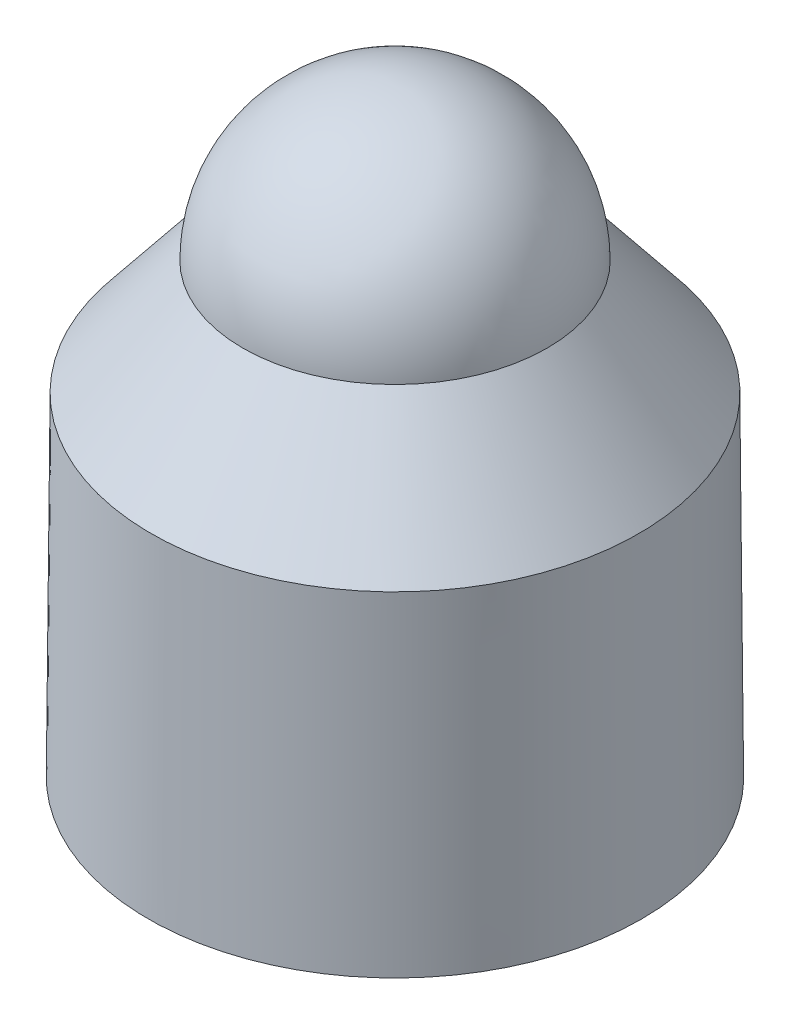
ISO-10303-21;
HEADER;
FILE_DESCRIPTION(('STEP AP214'),'2;1');
FILE_NAME('part.step','',(''),(''),'','','');
FILE_SCHEMA(('AUTOMOTIVE_DESIGN { 1 0 10303 214 1 1 1 1 }'));
ENDSEC;
DATA;
#1=APPLICATION_CONTEXT('core data for automotive mechanical design processes');
#2=APPLICATION_PROTOCOL_DEFINITION('international standard','automotive_design',2000,#1);
#3=PRODUCT_CONTEXT('',#1,'mechanical');
#4=PRODUCT('Part','Part','',(#3));
#5=PRODUCT_RELATED_PRODUCT_CATEGORY('part','',(#4));
#6=PRODUCT_DEFINITION_FORMATION('','',#4);
#7=PRODUCT_DEFINITION_CONTEXT('part definition',#1,'design');
#8=PRODUCT_DEFINITION('design','',#6,#7);
#9=PRODUCT_DEFINITION_SHAPE('','',#8);
#10=(LENGTH_UNIT() NAMED_UNIT(*) SI_UNIT(.MILLI.,.METRE.));
#11=(NAMED_UNIT(*) PLANE_ANGLE_UNIT() SI_UNIT($,.RADIAN.));
#12=(NAMED_UNIT(*) SI_UNIT($,.STERADIAN.) SOLID_ANGLE_UNIT());
#13=UNCERTAINTY_MEASURE_WITH_UNIT(LENGTH_MEASURE(1.E-05),#10,'distance_accuracy_value','');
#14=(GEOMETRIC_REPRESENTATION_CONTEXT(3) GLOBAL_UNCERTAINTY_ASSIGNED_CONTEXT((#13)) GLOBAL_UNIT_ASSIGNED_CONTEXT((#10,
#11,#12)) REPRESENTATION_CONTEXT('',''));
#15=CARTESIAN_POINT('',(0.,0.,0.));
#16=DIRECTION('',(0.,0.,1.));
#17=DIRECTION('',(1.,0.,0.));
#18=AXIS2_PLACEMENT_3D('',#15,#16,#17);
#19=CARTESIAN_POINT('',(0.,50.038,0.));
#20=DIRECTION('',(0.,-1.,0.));
#21=DIRECTION('',(1.,0.,0.));
#22=AXIS2_PLACEMENT_3D('',#19,#20,#21);
#23=CONICAL_SURFACE('',#22,122.555,0.0081227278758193);
#24=CARTESIAN_POINT('',(0.,215.267108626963,0.));
#25=DIRECTION('',(0.,1.,0.));
#26=DIRECTION('',(-1.,0.,0.));
#27=AXIS2_PLACEMENT_3D('',#24,#25,#26);
#28=CIRCLE('',#27,121.212859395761);
#29=CARTESIAN_POINT('',(-121.212859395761,215.267108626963,0.));
#30=VERTEX_POINT('',#29);
#31=EDGE_CURVE('E40',#30,#30,#28,.T.);
#32=ORIENTED_EDGE('',*,*,#31,.F.);
#33=EDGE_LOOP('',(#32));
#34=FACE_BOUND('',#33,.T.);
#35=CARTESIAN_POINT('',(0.,50.038,0.));
#36=DIRECTION('',(0.,1.,0.));
#37=DIRECTION('',(-1.,0.,0.));
#38=AXIS2_PLACEMENT_3D('',#35,#36,#37);
#39=CIRCLE('',#38,122.555);
#40=CARTESIAN_POINT('',(-122.555,50.038,0.));
#41=VERTEX_POINT('',#40);
#42=EDGE_CURVE('E10',#41,#41,#39,.T.);
#43=ORIENTED_EDGE('',*,*,#42,.T.);
#44=EDGE_LOOP('',(#43));
#45=FACE_BOUND('',#44,.T.);
#46=ADVANCED_FACE('F30',(#34,#45),#23,.T.);
#47=CARTESIAN_POINT('',(0.,50.038,0.));
#48=DIRECTION('',(0.,1.,0.));
#49=DIRECTION('',(-1.,0.,0.));
#50=AXIS2_PLACEMENT_3D('',#47,#48,#49);
#51=PLANE('',#50);
#52=ORIENTED_EDGE('',*,*,#42,.F.);
#53=EDGE_LOOP('',(#52));
#54=FACE_BOUND('',#53,.T.);
#55=ADVANCED_FACE('F50',(#54),#51,.F.);
#56=CARTESIAN_POINT('',(0.,271.92713991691,0.));
#57=DIRECTION('',(0.,1.,0.));
#58=DIRECTION('',(1.,0.,0.));
#59=AXIS2_PLACEMENT_3D('',#56,#57,#58);
#60=SPHERICAL_SURFACE('',#59,75.635683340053);
#61=CARTESIAN_POINT('',(0.,272.281831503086,0.));
#62=DIRECTION('',(0.,1.,0.));
#63=DIRECTION('',(-1.,0.,0.));
#64=AXIS2_PLACEMENT_3D('',#61,#62,#63);
#65=CIRCLE('',#64,75.6348516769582);
#66=CARTESIAN_POINT('',(-75.6348516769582,272.281831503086,0.));
#67=VERTEX_POINT('',#66);
#68=EDGE_CURVE('E36',#67,#67,#65,.T.);
#69=ORIENTED_EDGE('',*,*,#68,.T.);
#70=EDGE_LOOP('',(#69));
#71=FACE_BOUND('',#70,.T.);
#72=ADVANCED_FACE('F54',(#71),#60,.T.);
#73=CARTESIAN_POINT('',(0.,215.267108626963,0.));
#74=DIRECTION('',(0.,-1.,0.));
#75=DIRECTION('',(1.,0.,0.));
#76=AXIS2_PLACEMENT_3D('',#73,#74,#75);
#77=CONICAL_SURFACE('',#76,121.212859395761,0.674379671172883);
#78=ORIENTED_EDGE('',*,*,#68,.F.);
#79=EDGE_LOOP('',(#78));
#80=FACE_BOUND('',#79,.T.);
#81=ORIENTED_EDGE('',*,*,#31,.T.);
#82=EDGE_LOOP('',(#81));
#83=FACE_BOUND('',#82,.T.);
#84=ADVANCED_FACE('F47',(#80,#83),#77,.T.);
#85=CLOSED_SHELL('',(#46,#55,#72,#84));
#86=MANIFOLD_SOLID_BREP('B2',#85);
#87=ADVANCED_BREP_SHAPE_REPRESENTATION('',(#18,#86),#14);
#88=SHAPE_DEFINITION_REPRESENTATION(#9,#87);
ENDSEC;
END-ISO-10303-21;
